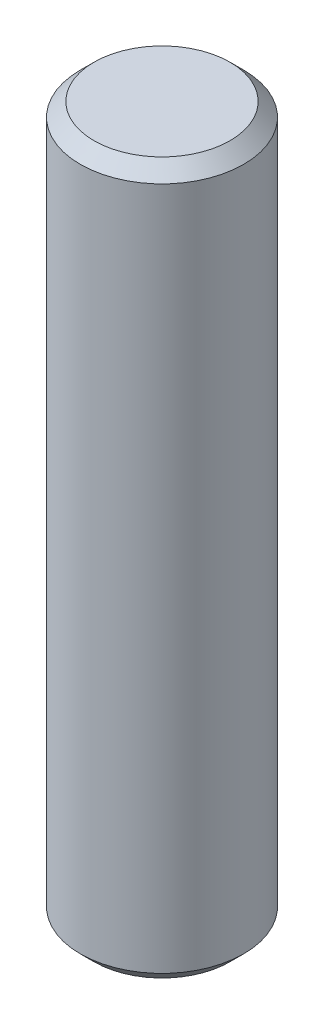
ISO-10303-21;
HEADER;
FILE_DESCRIPTION(('STEP AP214'),'2;1');
FILE_NAME('part.step','',(''),(''),'','','');
FILE_SCHEMA(('AUTOMOTIVE_DESIGN { 1 0 10303 214 1 1 1 1 }'));
ENDSEC;
DATA;
#1=APPLICATION_CONTEXT('core data for automotive mechanical design processes');
#2=APPLICATION_PROTOCOL_DEFINITION('international standard','automotive_design',2000,#1);
#3=PRODUCT_CONTEXT('',#1,'mechanical');
#4=PRODUCT('Part','Part','',(#3));
#5=PRODUCT_RELATED_PRODUCT_CATEGORY('part','',(#4));
#6=PRODUCT_DEFINITION_FORMATION('','',#4);
#7=PRODUCT_DEFINITION_CONTEXT('part definition',#1,'design');
#8=PRODUCT_DEFINITION('design','',#6,#7);
#9=PRODUCT_DEFINITION_SHAPE('','',#8);
#10=(LENGTH_UNIT() NAMED_UNIT(*) SI_UNIT(.MILLI.,.METRE.));
#11=(NAMED_UNIT(*) PLANE_ANGLE_UNIT() SI_UNIT($,.RADIAN.));
#12=(NAMED_UNIT(*) SI_UNIT($,.STERADIAN.) SOLID_ANGLE_UNIT());
#13=UNCERTAINTY_MEASURE_WITH_UNIT(LENGTH_MEASURE(1.E-05),#10,'distance_accuracy_value','');
#14=(GEOMETRIC_REPRESENTATION_CONTEXT(3) GLOBAL_UNCERTAINTY_ASSIGNED_CONTEXT((#13)) GLOBAL_UNIT_ASSIGNED_CONTEXT((#10,
#11,#12)) REPRESENTATION_CONTEXT('',''));
#15=CARTESIAN_POINT('',(0.,0.,0.));
#16=DIRECTION('',(0.,0.,1.));
#17=DIRECTION('',(1.,0.,0.));
#18=AXIS2_PLACEMENT_3D('',#15,#16,#17);
#19=CARTESIAN_POINT('',(0.,26.,0.));
#20=DIRECTION('',(0.,-1.,0.));
#21=DIRECTION('',(0.,0.,-1.));
#22=AXIS2_PLACEMENT_3D('',#19,#20,#21);
#23=CYLINDRICAL_SURFACE('',#22,2.987);
#24=CARTESIAN_POINT('',(0.,0.500000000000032,0.));
#25=DIRECTION('',(0.,1.,0.));
#26=DIRECTION('',(0.,0.,1.));
#27=AXIS2_PLACEMENT_3D('',#24,#25,#26);
#28=CIRCLE('',#27,2.987);
#29=CARTESIAN_POINT('',(0.,0.500000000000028,-2.987));
#30=VERTEX_POINT('',#29);
#31=EDGE_CURVE('E42',#30,#30,#28,.T.);
#32=CARTESIAN_POINT('',(0.,25.5,0.));
#33=DIRECTION('',(0.,1.,0.));
#34=DIRECTION('',(0.,0.,1.));
#35=AXIS2_PLACEMENT_3D('',#32,#33,#34);
#36=CIRCLE('',#35,2.987);
#37=CARTESIAN_POINT('',(0.,25.5,-2.987));
#38=VERTEX_POINT('',#37);
#39=EDGE_CURVE('E46',#38,#38,#36,.F.);
#40=CARTESIAN_POINT('',(0.,0.500000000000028,-2.987));
#41=CARTESIAN_POINT('',(0.,0.760416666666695,-2.987));
#42=CARTESIAN_POINT('',(0.,1.02083333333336,-2.987));
#43=CARTESIAN_POINT('',(0.,1.54166666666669,-2.987));
#44=CARTESIAN_POINT('',(0.,1.80208333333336,-2.987));
#45=CARTESIAN_POINT('',(0.,2.32291666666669,-2.987));
#46=CARTESIAN_POINT('',(0.,2.58333333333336,-2.987));
#47=CARTESIAN_POINT('',(0.,3.10416666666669,-2.987));
#48=CARTESIAN_POINT('',(0.,3.36458333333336,-2.987));
#49=CARTESIAN_POINT('',(0.,3.88541666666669,-2.987));
#50=CARTESIAN_POINT('',(0.,4.14583333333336,-2.987));
#51=CARTESIAN_POINT('',(0.,4.66666666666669,-2.987));
#52=CARTESIAN_POINT('',(0.,4.92708333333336,-2.987));
#53=CARTESIAN_POINT('',(0.,5.44791666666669,-2.987));
#54=CARTESIAN_POINT('',(0.,5.70833333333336,-2.987));
#55=CARTESIAN_POINT('',(0.,6.22916666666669,-2.987));
#56=CARTESIAN_POINT('',(0.,6.48958333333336,-2.987));
#57=CARTESIAN_POINT('',(0.,7.01041666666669,-2.987));
#58=CARTESIAN_POINT('',(0.,7.27083333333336,-2.987));
#59=CARTESIAN_POINT('',(0.,7.79166666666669,-2.987));
#60=CARTESIAN_POINT('',(0.,8.05208333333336,-2.987));
#61=CARTESIAN_POINT('',(0.,8.57291666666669,-2.987));
#62=CARTESIAN_POINT('',(0.,8.83333333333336,-2.987));
#63=CARTESIAN_POINT('',(0.,9.35416666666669,-2.987));
#64=CARTESIAN_POINT('',(0.,9.61458333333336,-2.987));
#65=CARTESIAN_POINT('',(0.,10.1354166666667,-2.987));
#66=CARTESIAN_POINT('',(0.,10.3958333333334,-2.987));
#67=CARTESIAN_POINT('',(0.,10.9166666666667,-2.987));
#68=CARTESIAN_POINT('',(0.,11.1770833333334,-2.987));
#69=CARTESIAN_POINT('',(0.,11.6979166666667,-2.987));
#70=CARTESIAN_POINT('',(0.,11.9583333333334,-2.987));
#71=CARTESIAN_POINT('',(0.,12.4791666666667,-2.987));
#72=CARTESIAN_POINT('',(0.,12.7395833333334,-2.987));
#73=CARTESIAN_POINT('',(0.,13.2604166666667,-2.987));
#74=CARTESIAN_POINT('',(0.,13.5208333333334,-2.987));
#75=CARTESIAN_POINT('',(0.,14.0416666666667,-2.987));
#76=CARTESIAN_POINT('',(0.,14.3020833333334,-2.987));
#77=CARTESIAN_POINT('',(0.,14.8229166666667,-2.987));
#78=CARTESIAN_POINT('',(0.,15.0833333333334,-2.987));
#79=CARTESIAN_POINT('',(0.,15.6041666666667,-2.987));
#80=CARTESIAN_POINT('',(0.,15.8645833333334,-2.987));
#81=CARTESIAN_POINT('',(0.,16.3854166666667,-2.987));
#82=CARTESIAN_POINT('',(0.,16.6458333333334,-2.987));
#83=CARTESIAN_POINT('',(0.,17.1666666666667,-2.987));
#84=CARTESIAN_POINT('',(0.,17.4270833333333,-2.987));
#85=CARTESIAN_POINT('',(0.,17.9479166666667,-2.987));
#86=CARTESIAN_POINT('',(0.,18.2083333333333,-2.987));
#87=CARTESIAN_POINT('',(0.,18.7291666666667,-2.987));
#88=CARTESIAN_POINT('',(0.,18.9895833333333,-2.987));
#89=CARTESIAN_POINT('',(0.,19.5104166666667,-2.987));
#90=CARTESIAN_POINT('',(0.,19.7708333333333,-2.987));
#91=CARTESIAN_POINT('',(0.,20.2916666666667,-2.987));
#92=CARTESIAN_POINT('',(0.,20.5520833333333,-2.987));
#93=CARTESIAN_POINT('',(0.,21.0729166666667,-2.987));
#94=CARTESIAN_POINT('',(0.,21.3333333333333,-2.987));
#95=CARTESIAN_POINT('',(0.,21.8541666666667,-2.987));
#96=CARTESIAN_POINT('',(0.,22.1145833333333,-2.987));
#97=CARTESIAN_POINT('',(0.,22.6354166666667,-2.987));
#98=CARTESIAN_POINT('',(0.,22.8958333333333,-2.987));
#99=CARTESIAN_POINT('',(0.,23.4166666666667,-2.987));
#100=CARTESIAN_POINT('',(0.,23.6770833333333,-2.987));
#101=CARTESIAN_POINT('',(0.,24.1979166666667,-2.987));
#102=CARTESIAN_POINT('',(0.,24.4583333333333,-2.987));
#103=CARTESIAN_POINT('',(0.,24.9791666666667,-2.987));
#104=CARTESIAN_POINT('',(0.,25.2395833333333,-2.987));
#105=CARTESIAN_POINT('',(0.,25.5,-2.987));
#106=B_SPLINE_CURVE_WITH_KNOTS('',3,(#40,#41,#42,#43,#44,#45,#46,#47,#48,#49,#50,#51,#52,#53,
#54,#55,#56,#57,#58,#59,#60,#61,#62,#63,#64,#65,#66,#67,#68,#69,#70,#71,#72,#73,#74,#75,#76,#77,
#78,#79,#80,#81,#82,#83,#84,#85,#86,#87,#88,#89,#90,#91,#92,#93,#94,#95,#96,#97,#98,#99,#100,
#101,#102,#103,#104,#105),.UNSPECIFIED.,.F.,.F.,(4,2,2,2,2,2,2,2,2,2,2,2,2,2,2,2,2,2,2,2,2,2,2,
2,2,2,2,2,2,2,2,2,4),(0.,0.781250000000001,1.5625,2.34375,3.125,3.90625,4.6875,5.46875,6.25,
7.03125,7.8125,8.59375,9.37499999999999,10.15625,10.9375,11.71875,12.5,13.28125,14.0625,
14.84375,15.625,16.40625,17.1875,17.96875,18.75,19.53125,20.3125,21.09375,21.875,22.65625,
23.4375,24.21875,25.),.UNSPECIFIED.);
#107=EDGE_CURVE('BSEAM31',#30,#38,#106,.T.);
#108=ORIENTED_EDGE('',*,*,#31,.T.);
#109=ORIENTED_EDGE('',*,*,#39,.T.);
#110=ORIENTED_EDGE('',*,*,#107,.T.);
#111=ORIENTED_EDGE('',*,*,#107,.F.);
#112=EDGE_LOOP('',(#108,#110,#109,#111));
#113=FACE_BOUND('',#112,.T.);
#114=ADVANCED_FACE('F31',(#113),#23,.T.);
#115=CARTESIAN_POINT('',(0.,26.,0.));
#116=DIRECTION('',(0.,1.,0.));
#117=DIRECTION('',(0.,0.,1.));
#118=AXIS2_PLACEMENT_3D('',#115,#116,#117);
#119=PLANE('',#118);
#120=CARTESIAN_POINT('',(0.,26.,0.));
#121=DIRECTION('',(0.,1.,0.));
#122=DIRECTION('',(0.,0.,1.));
#123=AXIS2_PLACEMENT_3D('',#120,#121,#122);
#124=CIRCLE('',#123,2.48700000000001);
#125=CARTESIAN_POINT('',(0.,26.,2.48700000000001));
#126=VERTEX_POINT('',#125);
#127=EDGE_CURVE('E10',#126,#126,#124,.T.);
#128=ORIENTED_EDGE('',*,*,#127,.T.);
#129=EDGE_LOOP('',(#128));
#130=FACE_BOUND('',#129,.T.);
#131=ADVANCED_FACE('F62',(#130),#119,.T.);
#132=CARTESIAN_POINT('',(0.,0.,0.));
#133=DIRECTION('',(0.,1.,0.));
#134=DIRECTION('',(0.,0.,1.));
#135=AXIS2_PLACEMENT_3D('',#132,#133,#134);
#136=PLANE('',#135);
#137=CARTESIAN_POINT('',(0.,0.,0.));
#138=DIRECTION('',(0.,1.,0.));
#139=DIRECTION('',(0.,0.,1.));
#140=AXIS2_PLACEMENT_3D('',#137,#138,#139);
#141=CIRCLE('',#140,2.48699999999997);
#142=CARTESIAN_POINT('',(0.,0.,2.48699999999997));
#143=VERTEX_POINT('',#142);
#144=EDGE_CURVE('E38',#143,#143,#141,.F.);
#145=ORIENTED_EDGE('',*,*,#144,.T.);
#146=EDGE_LOOP('',(#145));
#147=FACE_BOUND('',#146,.T.);
#148=ADVANCED_FACE('F59',(#147),#136,.F.);
#149=CARTESIAN_POINT('',(0.,0.500000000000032,0.));
#150=DIRECTION('',(0.,1.,0.));
#151=DIRECTION('',(0.,0.,1.));
#152=AXIS2_PLACEMENT_3D('',#149,#150,#151);
#153=CONICAL_SURFACE('',#152,2.987,0.785398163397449);
#154=ORIENTED_EDGE('',*,*,#144,.F.);
#155=EDGE_LOOP('',(#154));
#156=FACE_BOUND('',#155,.T.);
#157=ORIENTED_EDGE('',*,*,#31,.F.);
#158=EDGE_LOOP('',(#157));
#159=FACE_BOUND('',#158,.T.);
#160=ADVANCED_FACE('F55',(#156,#159),#153,.T.);
#161=CARTESIAN_POINT('',(0.,26.,0.));
#162=DIRECTION('',(0.,-1.,0.));
#163=DIRECTION('',(0.,0.,-1.));
#164=AXIS2_PLACEMENT_3D('',#161,#162,#163);
#165=CONICAL_SURFACE('',#164,2.48700000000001,0.785398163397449);
#166=ORIENTED_EDGE('',*,*,#39,.F.);
#167=EDGE_LOOP('',(#166));
#168=FACE_BOUND('',#167,.T.);
#169=ORIENTED_EDGE('',*,*,#127,.F.);
#170=EDGE_LOOP('',(#169));
#171=FACE_BOUND('',#170,.T.);
#172=ADVANCED_FACE('F33',(#168,#171),#165,.T.);
#173=CLOSED_SHELL('',(#114,#131,#148,#160,#172));
#174=MANIFOLD_SOLID_BREP('B2',#173);
#175=ADVANCED_BREP_SHAPE_REPRESENTATION('',(#18,#174),#14);
#176=SHAPE_DEFINITION_REPRESENTATION(#9,#175);
ENDSEC;
END-ISO-10303-21;
